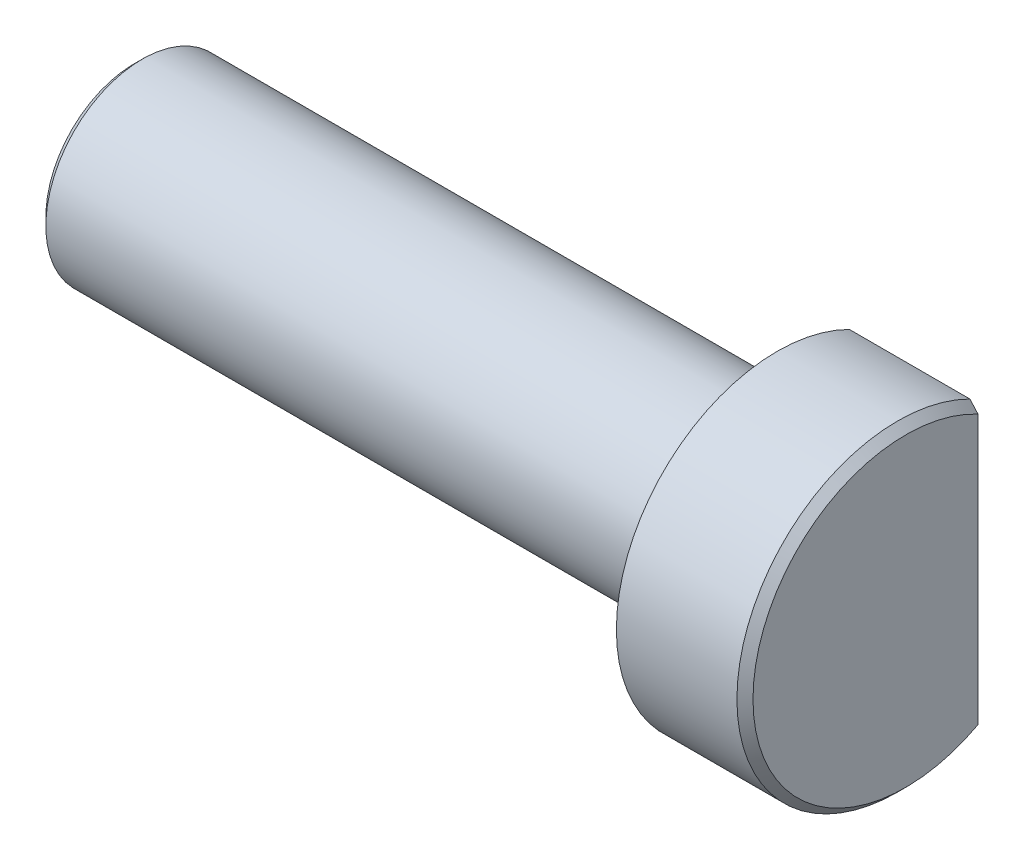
ISO-10303-21;
HEADER;
FILE_DESCRIPTION(('STEP AP214'),'2;1');
FILE_NAME('part.step','',(''),(''),'','','');
FILE_SCHEMA(('AUTOMOTIVE_DESIGN { 1 0 10303 214 1 1 1 1 }'));
ENDSEC;
DATA;
#1=APPLICATION_CONTEXT('core data for automotive mechanical design processes');
#2=APPLICATION_PROTOCOL_DEFINITION('international standard','automotive_design',2000,#1);
#3=PRODUCT_CONTEXT('',#1,'mechanical');
#4=PRODUCT('Part','Part','',(#3));
#5=PRODUCT_RELATED_PRODUCT_CATEGORY('part','',(#4));
#6=PRODUCT_DEFINITION_FORMATION('','',#4);
#7=PRODUCT_DEFINITION_CONTEXT('part definition',#1,'design');
#8=PRODUCT_DEFINITION('design','',#6,#7);
#9=PRODUCT_DEFINITION_SHAPE('','',#8);
#10=(LENGTH_UNIT() NAMED_UNIT(*) SI_UNIT(.MILLI.,.METRE.));
#11=(NAMED_UNIT(*) PLANE_ANGLE_UNIT() SI_UNIT($,.RADIAN.));
#12=(NAMED_UNIT(*) SI_UNIT($,.STERADIAN.) SOLID_ANGLE_UNIT());
#13=UNCERTAINTY_MEASURE_WITH_UNIT(LENGTH_MEASURE(1.E-05),#10,'distance_accuracy_value','');
#14=(GEOMETRIC_REPRESENTATION_CONTEXT(3) GLOBAL_UNCERTAINTY_ASSIGNED_CONTEXT((#13)) GLOBAL_UNIT_ASSIGNED_CONTEXT((#10,
#11,#12)) REPRESENTATION_CONTEXT('',''));
#15=CARTESIAN_POINT('',(0.,0.,0.));
#16=DIRECTION('',(0.,0.,1.));
#17=DIRECTION('',(1.,0.,0.));
#18=AXIS2_PLACEMENT_3D('',#15,#16,#17);
#19=CARTESIAN_POINT('',(-12.,10.,0.));
#20=DIRECTION('',(-1.,0.,0.));
#21=DIRECTION('',(0.,0.,1.));
#22=AXIS2_PLACEMENT_3D('',#19,#20,#21);
#23=PLANE('',#22);
#24=DIRECTION('',(0.,-1.,0.));
#25=VECTOR('',#24,1.);
#26=CARTESIAN_POINT('',(-12.,8.93028554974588,-4.5));
#27=LINE('',#26,#25);
#28=CARTESIAN_POINT('',(-12.,8.36660026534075,-4.5));
#29=VERTEX_POINT('',#28);
#30=CARTESIAN_POINT('',(-12.,-8.36660026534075,-4.5));
#31=VERTEX_POINT('',#30);
#32=EDGE_CURVE('E98',#29,#31,#27,.T.);
#33=ORIENTED_EDGE('',*,*,#32,.F.);
#34=CARTESIAN_POINT('',(-12.,0.,0.));
#35=DIRECTION('',(-1.,0.,0.));
#36=DIRECTION('',(0.,0.,1.));
#37=AXIS2_PLACEMENT_3D('',#34,#35,#36);
#38=CIRCLE('',#37,9.5);
#39=EDGE_CURVE('E11',#29,#31,#38,.F.);
#40=ORIENTED_EDGE('',*,*,#39,.T.);
#41=EDGE_LOOP('',(#33,#40));
#42=FACE_BOUND('',#41,.T.);
#43=ADVANCED_FACE('F36',(#42),#23,.F.);
#44=CARTESIAN_POINT('',(-100.,0.,0.));
#45=DIRECTION('',(-1.,0.,0.));
#46=DIRECTION('',(0.,0.,1.));
#47=AXIS2_PLACEMENT_3D('',#44,#45,#46);
#48=CYLINDRICAL_SURFACE('',#47,10.);
#49=DIRECTION('',(1.,0.,0.));
#50=VECTOR('',#49,1.);
#51=CARTESIAN_POINT('',(-21.5,-8.93028554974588,-4.5));
#52=LINE('',#51,#50);
#53=CARTESIAN_POINT('',(-20.,-8.93028554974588,-4.5));
#54=VERTEX_POINT('',#53);
#55=CARTESIAN_POINT('',(-12.5,-8.93028554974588,-4.5));
#56=VERTEX_POINT('',#55);
#57=EDGE_CURVE('E97',#54,#56,#52,.T.);
#58=ORIENTED_EDGE('',*,*,#57,.T.);
#59=CARTESIAN_POINT('',(-12.5,0.,0.));
#60=DIRECTION('',(-1.,0.,0.));
#61=DIRECTION('',(0.,0.,1.));
#62=AXIS2_PLACEMENT_3D('',#59,#60,#61);
#63=CIRCLE('',#62,10.);
#64=CARTESIAN_POINT('',(-12.5,8.93028554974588,-4.5));
#65=VERTEX_POINT('',#64);
#66=EDGE_CURVE('E96',#56,#65,#63,.T.);
#67=ORIENTED_EDGE('',*,*,#66,.T.);
#68=DIRECTION('',(1.,0.,0.));
#69=VECTOR('',#68,1.);
#70=CARTESIAN_POINT('',(-21.5,8.93028554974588,-4.5));
#71=LINE('',#70,#69);
#72=CARTESIAN_POINT('',(-20.,8.93028554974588,-4.5));
#73=VERTEX_POINT('',#72);
#74=EDGE_CURVE('E78',#73,#65,#71,.T.);
#75=ORIENTED_EDGE('',*,*,#74,.F.);
#76=CARTESIAN_POINT('',(-20.,0.,0.));
#77=DIRECTION('',(-1.,0.,0.));
#78=DIRECTION('',(0.,0.,1.));
#79=AXIS2_PLACEMENT_3D('',#76,#77,#78);
#80=CIRCLE('',#79,10.);
#81=EDGE_CURVE('E94',#54,#73,#80,.T.);
#82=ORIENTED_EDGE('',*,*,#81,.F.);
#83=EDGE_LOOP('',(#58,#67,#75,#82));
#84=FACE_BOUND('',#83,.T.);
#85=ADVANCED_FACE('F93',(#84),#48,.T.);
#86=CARTESIAN_POINT('',(-20.,6.,0.));
#87=DIRECTION('',(1.,0.,0.));
#88=DIRECTION('',(0.,0.,-1.));
#89=AXIS2_PLACEMENT_3D('',#86,#87,#88);
#90=PLANE('',#89);
#91=ORIENTED_EDGE('',*,*,#81,.T.);
#92=DIRECTION('',(0.,-1.,0.));
#93=VECTOR('',#92,1.);
#94=CARTESIAN_POINT('',(-20.,6.,-4.5));
#95=LINE('',#94,#93);
#96=CARTESIAN_POINT('',(-20.,3.96862696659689,-4.5));
#97=VERTEX_POINT('',#96);
#98=EDGE_CURVE('E75',#73,#97,#95,.T.);
#99=ORIENTED_EDGE('',*,*,#98,.T.);
#100=CARTESIAN_POINT('',(-20.,0.,0.));
#101=DIRECTION('',(-1.,0.,0.));
#102=DIRECTION('',(0.,0.,1.));
#103=AXIS2_PLACEMENT_3D('',#100,#101,#102);
#104=CIRCLE('',#103,6.);
#105=CARTESIAN_POINT('',(-20.,-3.96862696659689,-4.5));
#106=VERTEX_POINT('',#105);
#107=EDGE_CURVE('E86',#106,#97,#104,.T.);
#108=ORIENTED_EDGE('',*,*,#107,.F.);
#109=EDGE_CURVE('E87',#106,#54,#95,.T.);
#110=ORIENTED_EDGE('',*,*,#109,.T.);
#111=EDGE_LOOP('',(#91,#99,#108,#110));
#112=FACE_BOUND('',#111,.T.);
#113=ADVANCED_FACE('F101',(#112),#90,.F.);
#114=CARTESIAN_POINT('',(-100.,0.,0.));
#115=DIRECTION('',(-1.,0.,0.));
#116=DIRECTION('',(0.,0.,1.));
#117=AXIS2_PLACEMENT_3D('',#114,#115,#116);
#118=CYLINDRICAL_SURFACE('',#117,6.);
#119=CARTESIAN_POINT('',(-59.5,0.,0.));
#120=DIRECTION('',(1.,0.,0.));
#121=DIRECTION('',(0.,0.,-1.));
#122=AXIS2_PLACEMENT_3D('',#119,#120,#121);
#123=CIRCLE('',#122,6.);
#124=CARTESIAN_POINT('',(-59.5,0.,-6.));
#125=VERTEX_POINT('',#124);
#126=EDGE_CURVE('E159',#125,#125,#123,.T.);
#127=ORIENTED_EDGE('',*,*,#126,.T.);
#128=EDGE_LOOP('',(#127));
#129=FACE_BOUND('',#128,.T.);
#130=ORIENTED_EDGE('',*,*,#107,.T.);
#131=CARTESIAN_POINT('',(-20.,3.96862696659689,-4.5));
#132=CARTESIAN_POINT('',(-20.0312263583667,3.96863242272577,-4.49999221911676));
#133=CARTESIAN_POINT('',(-20.0624478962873,3.96752152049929,-4.50097484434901));
#134=CARTESIAN_POINT('',(-20.1245966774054,3.96310939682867,-4.50486177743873));
#135=CARTESIAN_POINT('',(-20.1555240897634,3.95980952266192,-4.50776490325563));
#136=CARTESIAN_POINT('',(-20.2166061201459,3.95109498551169,-4.5154047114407));
#137=CARTESIAN_POINT('',(-20.2467648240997,3.94569657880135,-4.52012729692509));
#138=CARTESIAN_POINT('',(-20.3063137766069,3.93286513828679,-4.53129608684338));
#139=CARTESIAN_POINT('',(-20.335703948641,3.92543190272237,-4.53774246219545));
#140=CARTESIAN_POINT('',(-20.4222844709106,3.90025048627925,-4.55944495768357));
#141=CARTESIAN_POINT('',(-20.4780705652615,3.87959342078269,-4.57708883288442));
#142=CARTESIAN_POINT('',(-20.5846606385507,3.831465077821,-4.61745176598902));
#143=CARTESIAN_POINT('',(-20.6354552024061,3.80398125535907,-4.64018015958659));
#144=CARTESIAN_POINT('',(-20.7480278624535,3.73274100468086,-4.69780605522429));
#145=CARTESIAN_POINT('',(-20.8075579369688,3.68664084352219,-4.73419788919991));
#146=CARTESIAN_POINT('',(-20.9164695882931,3.58630303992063,-4.81065870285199));
#147=CARTESIAN_POINT('',(-20.9658342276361,3.53205207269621,-4.85073366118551));
#148=CARTESIAN_POINT('',(-21.0767566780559,3.38969828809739,-4.95184069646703));
#149=CARTESIAN_POINT('',(-21.132754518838,3.29786628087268,-5.01367945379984));
#150=CARTESIAN_POINT('',(-21.2282169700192,3.10492027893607,-5.13542516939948));
#151=CARTESIAN_POINT('',(-21.2676483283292,3.00378810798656,-5.1953280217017));
#152=CARTESIAN_POINT('',(-21.3290296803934,2.81013996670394,-5.30222060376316));
#153=CARTESIAN_POINT('',(-21.3526798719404,2.71848211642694,-5.34982730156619));
#154=CARTESIAN_POINT('',(-21.3927549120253,2.53150948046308,-5.44079771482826));
#155=CARTESIAN_POINT('',(-21.409174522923,2.43619209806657,-5.4841583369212));
#156=CARTESIAN_POINT('',(-21.4365681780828,2.24235010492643,-5.566237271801));
#157=CARTESIAN_POINT('',(-21.4475183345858,2.14381339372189,-5.60493466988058));
#158=CARTESIAN_POINT('',(-21.4653145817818,1.94453549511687,-5.67714862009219));
#159=CARTESIAN_POINT('',(-21.4721613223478,1.8437946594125,-5.71066599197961));
#160=CARTESIAN_POINT('',(-21.4850800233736,1.60053936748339,-5.78447671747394));
#161=CARTESIAN_POINT('',(-21.4897872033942,1.45718434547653,-5.82224734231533));
#162=CARTESIAN_POINT('',(-21.4960990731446,1.16795433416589,-5.88709281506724));
#163=CARTESIAN_POINT('',(-21.4977024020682,1.02207826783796,-5.91416296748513));
#164=CARTESIAN_POINT('',(-21.4990810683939,0.802968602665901,-5.94647872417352));
#165=CARTESIAN_POINT('',(-21.4993708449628,0.730322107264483,-5.9558370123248));
#166=CARTESIAN_POINT('',(-21.4997584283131,0.584730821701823,-5.97188849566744));
#167=CARTESIAN_POINT('',(-21.4998562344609,0.511786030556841,-5.97858168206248));
#168=CARTESIAN_POINT('',(-21.4999717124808,0.365749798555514,-5.98928909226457));
#169=CARTESIAN_POINT('',(-21.4999894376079,0.292658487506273,-5.99330509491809));
#170=CARTESIAN_POINT('',(-21.4999998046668,0.146378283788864,-5.99866082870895));
#171=CARTESIAN_POINT('',(-21.4999924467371,0.0731893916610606,-6.00000057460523));
#172=CARTESIAN_POINT('',(-21.5,0.,-6.));
#173=B_SPLINE_CURVE_WITH_KNOTS('',3,(#131,#132,#133,#134,#135,#136,#137,#138,#139,#140,#141,
#142,#143,#144,#145,#146,#147,#148,#149,#150,#151,#152,#153,#154,#155,#156,#157,#158,#159,#160,
#161,#162,#163,#164,#165,#166,#167,#168,#169,#170,#171,#172),.UNSPECIFIED.,.F.,.F.,(4,2,2,2,2,2,
2,2,2,2,2,2,2,2,2,2,2,2,2,2,4),(0.,0.0936359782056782,0.187214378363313,0.280081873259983,
0.372958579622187,0.558151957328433,0.743688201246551,0.993169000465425,1.24306217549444,
1.6131811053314,1.98403942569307,2.30146204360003,2.61911421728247,2.93814185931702,
3.25711896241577,3.70160008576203,4.14627603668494,4.36597758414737,4.58567985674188,
4.80523600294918,5.02479093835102),.UNSPECIFIED.);
#174=CARTESIAN_POINT('',(-21.5,0.,-6.));
#175=VERTEX_POINT('',#174);
#176=EDGE_CURVE('E113',#97,#175,#173,.T.);
#177=ORIENTED_EDGE('',*,*,#176,.T.);
#178=CARTESIAN_POINT('',(-21.5,0.,-6.));
#179=CARTESIAN_POINT('',(-21.4999874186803,-0.0831578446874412,-6.00000097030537));
#180=CARTESIAN_POINT('',(-21.4999996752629,-0.166314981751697,-5.99827119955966));
#181=CARTESIAN_POINT('',(-21.4999823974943,-0.332487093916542,-5.99135750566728));
#182=CARTESIAN_POINT('',(-21.4999528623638,-0.415502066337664,-5.98617351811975));
#183=CARTESIAN_POINT('',(-21.4997603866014,-0.581367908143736,-5.97234855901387));
#184=CARTESIAN_POINT('',(-21.4995972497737,-0.664218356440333,-5.96370251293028));
#185=CARTESIAN_POINT('',(-21.4989507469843,-0.829480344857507,-5.94297058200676));
#186=CARTESIAN_POINT('',(-21.4984673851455,-0.911891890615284,-5.9308847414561));
#187=CARTESIAN_POINT('',(-21.4961743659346,-1.15947669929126,-5.88929127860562));
#188=CARTESIAN_POINT('',(-21.4935166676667,-1.32379412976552,-5.85454802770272));
#189=CARTESIAN_POINT('',(-21.4830824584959,-1.64867171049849,-5.77147652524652));
#190=CARTESIAN_POINT('',(-21.4753110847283,-1.80923546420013,-5.72316193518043));
#191=CARTESIAN_POINT('',(-21.4568628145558,-2.04357422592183,-5.64184015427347));
#192=CARTESIAN_POINT('',(-21.4497547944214,-2.119377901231,-5.61379982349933));
#193=CARTESIAN_POINT('',(-21.432738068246,-2.26952789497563,-5.55479480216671));
#194=CARTESIAN_POINT('',(-21.4228294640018,-2.34387426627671,-5.52383021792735));
#195=CARTESIAN_POINT('',(-21.399541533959,-2.49068744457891,-5.45920274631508));
#196=CARTESIAN_POINT('',(-21.3861682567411,-2.5631572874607,-5.42554463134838));
#197=CARTESIAN_POINT('',(-21.3551423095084,-2.70594629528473,-5.35576082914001));
#198=CARTESIAN_POINT('',(-21.3374904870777,-2.77626588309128,-5.31963563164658));
#199=CARTESIAN_POINT('',(-21.2855419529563,-2.95335700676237,-5.22424200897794));
#200=CARTESIAN_POINT('',(-21.2474773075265,-3.0582562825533,-5.16343788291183));
#201=CARTESIAN_POINT('',(-21.1545519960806,-3.25876291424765,-5.03927101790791));
#202=CARTESIAN_POINT('',(-21.099728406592,-3.35439017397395,-4.97591419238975));
#203=CARTESIAN_POINT('',(-20.9926088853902,-3.49996132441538,-4.87392451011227));
#204=CARTESIAN_POINT('',(-20.9465094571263,-3.55395710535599,-4.83460281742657));
#205=CARTESIAN_POINT('',(-20.8448121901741,-3.6546805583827,-4.75891286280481));
#206=CARTESIAN_POINT('',(-20.7892242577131,-3.70141571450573,-4.72254157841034));
#207=CARTESIAN_POINT('',(-20.6795627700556,-3.77778065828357,-4.6615786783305));
#208=CARTESIAN_POINT('',(-20.6271055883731,-3.80897548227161,-4.63605210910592));
#209=CARTESIAN_POINT('',(-20.5162938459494,-3.86388669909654,-4.59038739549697));
#210=CARTESIAN_POINT('',(-20.4579523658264,-3.88761921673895,-4.57023764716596));
#211=CARTESIAN_POINT('',(-20.3661272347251,-3.91702467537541,-4.54500720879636));
#212=CARTESIAN_POINT('',(-20.3343229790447,-3.92587214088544,-4.537359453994));
#213=CARTESIAN_POINT('',(-20.2697228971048,-3.94116578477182,-4.52408161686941));
#214=CARTESIAN_POINT('',(-20.236927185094,-3.9476122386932,-4.51845130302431));
#215=CARTESIAN_POINT('',(-20.1703115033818,-3.95804306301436,-4.50931776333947));
#216=CARTESIAN_POINT('',(-20.1364845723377,-3.96200217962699,-4.50583636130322));
#217=CARTESIAN_POINT('',(-20.0684410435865,-3.96729918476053,-4.50117090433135));
#218=CARTESIAN_POINT('',(-20.0342241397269,-3.96863484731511,-4.49998880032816));
#219=CARTESIAN_POINT('',(-20.,-3.96862696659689,-4.5));
#220=B_SPLINE_CURVE_WITH_KNOTS('',3,(#178,#179,#180,#181,#182,#183,#184,#185,#186,#187,#188,
#189,#190,#191,#192,#193,#194,#195,#196,#197,#198,#199,#200,#201,#202,#203,#204,#205,#206,#207,
#208,#209,#210,#211,#212,#213,#214,#215,#216,#217,#218,#219),.UNSPECIFIED.,.F.,.F.,(4,2,2,2,2,2,
2,2,2,2,2,2,2,2,2,2,2,2,2,2,4),(0.,0.249454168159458,0.498912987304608,0.748738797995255,
0.998561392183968,1.50182541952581,2.00458464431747,2.24789932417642,2.49120516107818,
2.73408906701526,2.97692489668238,3.35707490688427,3.73638990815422,3.97913792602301,
4.22163404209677,4.41934434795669,4.61662445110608,4.71814873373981,4.81966136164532,
4.92218865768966,5.02480290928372),.UNSPECIFIED.);
#221=EDGE_CURVE('E103',#175,#106,#220,.T.);
#222=ORIENTED_EDGE('',*,*,#221,.T.);
#223=EDGE_LOOP('',(#130,#177,#222));
#224=FACE_BOUND('',#223,.T.);
#225=ADVANCED_FACE('F118',(#129,#224),#118,.T.);
#226=CARTESIAN_POINT('',(-60.,0.,0.));
#227=DIRECTION('',(1.,0.,0.));
#228=DIRECTION('',(0.,0.,-1.));
#229=AXIS2_PLACEMENT_3D('',#226,#227,#228);
#230=PLANE('',#229);
#231=CARTESIAN_POINT('',(-60.,0.,0.));
#232=DIRECTION('',(1.,0.,0.));
#233=DIRECTION('',(0.,0.,-1.));
#234=AXIS2_PLACEMENT_3D('',#231,#232,#233);
#235=CIRCLE('',#234,5.49999999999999);
#236=CARTESIAN_POINT('',(-60.,0.,-5.49999999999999));
#237=VERTEX_POINT('',#236);
#238=EDGE_CURVE('E161',#237,#237,#235,.F.);
#239=ORIENTED_EDGE('',*,*,#238,.T.);
#240=EDGE_LOOP('',(#239));
#241=FACE_BOUND('',#240,.T.);
#242=ADVANCED_FACE('F133',(#241),#230,.F.);
#243=CARTESIAN_POINT('',(-21.5,8.93028554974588,-4.5));
#244=DIRECTION('',(0.,0.,1.));
#245=DIRECTION('',(0.,-1.,0.));
#246=AXIS2_PLACEMENT_3D('',#243,#244,#245);
#247=PLANE('',#246);
#248=ORIENTED_EDGE('',*,*,#74,.T.);
#249=CARTESIAN_POINT('',(-12.5,8.93028554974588,-4.5));
#250=CARTESIAN_POINT('',(-12.4163426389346,8.8366254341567,-4.5));
#251=CARTESIAN_POINT('',(-12.3328472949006,8.74282160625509,-4.5));
#252=CARTESIAN_POINT('',(-12.1661806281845,8.55492651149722,-4.5));
#253=CARTESIAN_POINT('',(-12.0830093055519,8.46083524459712,-4.5));
#254=CARTESIAN_POINT('',(-12.,8.36660026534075,-4.5));
#255=B_SPLINE_CURVE_WITH_KNOTS('',3,(#249,#250,#251,#252,#253,#254),.UNSPECIFIED.,.F.,.F.,(4,2,
4),(0.,0.376743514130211,0.753487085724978),.UNSPECIFIED.);
#256=EDGE_CURVE('E43',#65,#29,#255,.T.);
#257=ORIENTED_EDGE('',*,*,#256,.T.);
#258=ORIENTED_EDGE('',*,*,#32,.T.);
#259=CARTESIAN_POINT('',(-12.,-8.36660026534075,-4.5));
#260=CARTESIAN_POINT('',(-12.0830093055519,-8.46083524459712,-4.5));
#261=CARTESIAN_POINT('',(-12.1661806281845,-8.55492651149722,-4.5));
#262=CARTESIAN_POINT('',(-12.3328472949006,-8.74282160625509,-4.5));
#263=CARTESIAN_POINT('',(-12.4163426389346,-8.8366254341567,-4.5));
#264=CARTESIAN_POINT('',(-12.5,-8.93028554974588,-4.5));
#265=B_SPLINE_CURVE_WITH_KNOTS('',3,(#259,#260,#261,#262,#263,#264),.UNSPECIFIED.,.F.,.F.,(4,2,
4),(0.,0.376743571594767,0.753487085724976),.UNSPECIFIED.);
#266=EDGE_CURVE('E136',#31,#56,#265,.T.);
#267=ORIENTED_EDGE('',*,*,#266,.T.);
#268=ORIENTED_EDGE('',*,*,#57,.F.);
#269=ORIENTED_EDGE('',*,*,#109,.F.);
#270=DIRECTION('',(0.,-1.,0.));
#271=VECTOR('',#270,1.);
#272=CARTESIAN_POINT('',(-20.,8.93028554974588,-4.5));
#273=LINE('',#272,#271);
#274=EDGE_CURVE('E81',#106,#97,#273,.F.);
#275=ORIENTED_EDGE('',*,*,#274,.T.);
#276=ORIENTED_EDGE('',*,*,#98,.F.);
#277=EDGE_LOOP('',(#248,#257,#258,#267,#268,#269,#275,#276));
#278=FACE_BOUND('',#277,.T.);
#279=ADVANCED_FACE('F77',(#278),#247,.F.);
#280=CARTESIAN_POINT('',(-20.,0.,-6.));
#281=DIRECTION('',(0.,-1.,0.));
#282=DIRECTION('',(0.,0.,-1.));
#283=AXIS2_PLACEMENT_3D('',#280,#281,#282);
#284=CYLINDRICAL_SURFACE('',#283,1.5);
#285=ORIENTED_EDGE('',*,*,#176,.F.);
#286=ORIENTED_EDGE('',*,*,#274,.F.);
#287=ORIENTED_EDGE('',*,*,#221,.F.);
#288=EDGE_LOOP('',(#285,#286,#287));
#289=FACE_BOUND('',#288,.T.);
#290=ADVANCED_FACE('F122',(#289),#284,.F.);
#291=CARTESIAN_POINT('',(-60.,0.,0.));
#292=DIRECTION('',(1.,0.,0.));
#293=DIRECTION('',(0.,0.,-1.));
#294=AXIS2_PLACEMENT_3D('',#291,#292,#293);
#295=CONICAL_SURFACE('',#294,5.49999999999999,0.785398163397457);
#296=ORIENTED_EDGE('',*,*,#126,.F.);
#297=EDGE_LOOP('',(#296));
#298=FACE_BOUND('',#297,.T.);
#299=ORIENTED_EDGE('',*,*,#238,.F.);
#300=EDGE_LOOP('',(#299));
#301=FACE_BOUND('',#300,.T.);
#302=ADVANCED_FACE('F127',(#298,#301),#295,.T.);
#303=CARTESIAN_POINT('',(-12.5,0.,0.));
#304=DIRECTION('',(-1.,0.,0.));
#305=DIRECTION('',(0.,0.,1.));
#306=AXIS2_PLACEMENT_3D('',#303,#304,#305);
#307=CONICAL_SURFACE('',#306,10.,0.785398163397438);
#308=ORIENTED_EDGE('',*,*,#266,.F.);
#309=ORIENTED_EDGE('',*,*,#39,.F.);
#310=ORIENTED_EDGE('',*,*,#256,.F.);
#311=ORIENTED_EDGE('',*,*,#66,.F.);
#312=EDGE_LOOP('',(#308,#309,#310,#311));
#313=FACE_BOUND('',#312,.T.);
#314=ADVANCED_FACE('F144',(#313),#307,.T.);
#315=CLOSED_SHELL('',(#43,#85,#113,#225,#242,#279,#290,#302,#314));
#316=MANIFOLD_SOLID_BREP('B2',#315);
#317=ADVANCED_BREP_SHAPE_REPRESENTATION('',(#18,#316),#14);
#318=SHAPE_DEFINITION_REPRESENTATION(#9,#317);
ENDSEC;
END-ISO-10303-21;
